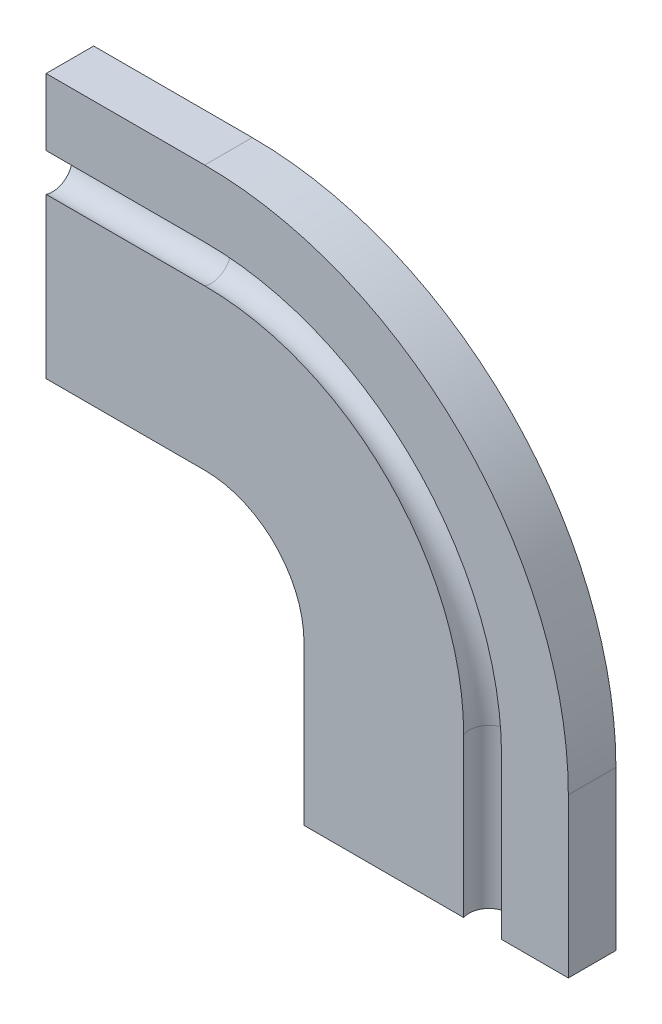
from build123d import *


with BuildPart() as part:
    # Sweep1: sweep along a path in Sketch1
    with BuildLine(Plane.XY) as sweep1_path:
        Line((-50, 50), (-20, 50))
        ThreePointArc((-20, 50), (-5.857864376, 44.142135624), (0, 30))
        Line((0, 30), (0, 0))
    # Sketch2 → Sweep1 (sweep)
    with BuildSketch(Plane(origin=(0, 0, 0), x_dir=(1, 0, 0), z_dir=(0, 1, 0))):
        with BuildLine():
            Line((-1.214, -1.214), (28.985915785, -1.214))
            ThreePointArc((28.985915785, -1.214), (32.572, 3.786), (36.158084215, -1.214))
            Line((36.158084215, -1.214), (48.786, -1.214))
            Line((48.786, -1.214), (48.786, 7.786))
            Line((48.786, 7.786), (47.572, 7.786))
            Line((47.572, 7.786), (47.572, 0))
            Line((47.572, 0), (37.572, 0))
            ThreePointArc((37.572, 0), (32.572, 5), (27.572, 0))
            Line((27.572, 0), (0, 0))
            Line((0, 0), (0, 7.786))
            Line((0, 7.786), (-1.214, 7.786))
            Line((-1.214, 7.786), (-1.214, -1.214))
        make_face()
    sweep(path=sweep1_path.line)


solid = part.part
